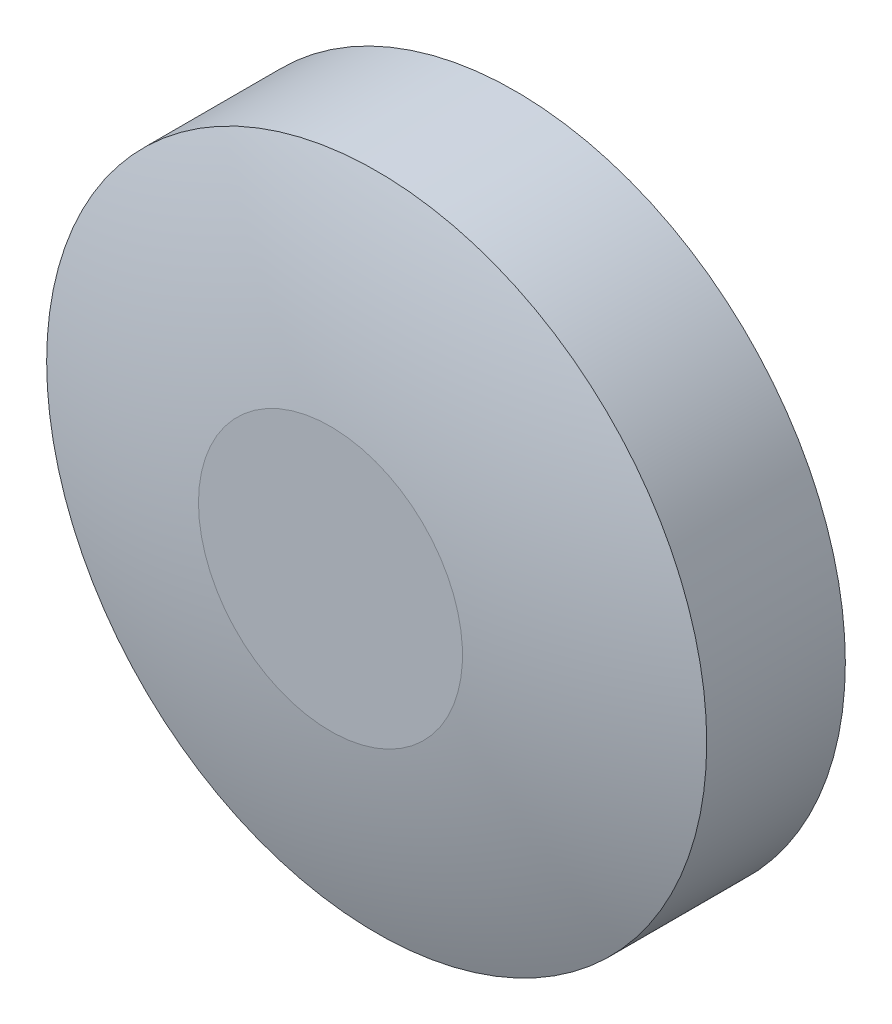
ISO-10303-21;
HEADER;
FILE_DESCRIPTION(('STEP AP214'),'2;1');
FILE_NAME('part.step','',(''),(''),'','','');
FILE_SCHEMA(('AUTOMOTIVE_DESIGN { 1 0 10303 214 1 1 1 1 }'));
ENDSEC;
DATA;
#1=APPLICATION_CONTEXT('core data for automotive mechanical design processes');
#2=APPLICATION_PROTOCOL_DEFINITION('international standard','automotive_design',2000,#1);
#3=PRODUCT_CONTEXT('',#1,'mechanical');
#4=PRODUCT('Part','Part','',(#3));
#5=PRODUCT_RELATED_PRODUCT_CATEGORY('part','',(#4));
#6=PRODUCT_DEFINITION_FORMATION('','',#4);
#7=PRODUCT_DEFINITION_CONTEXT('part definition',#1,'design');
#8=PRODUCT_DEFINITION('design','',#6,#7);
#9=PRODUCT_DEFINITION_SHAPE('','',#8);
#10=(LENGTH_UNIT() NAMED_UNIT(*) SI_UNIT(.MILLI.,.METRE.));
#11=(NAMED_UNIT(*) PLANE_ANGLE_UNIT() SI_UNIT($,.RADIAN.));
#12=(NAMED_UNIT(*) SI_UNIT($,.STERADIAN.) SOLID_ANGLE_UNIT());
#13=UNCERTAINTY_MEASURE_WITH_UNIT(LENGTH_MEASURE(1.E-05),#10,'distance_accuracy_value','');
#14=(GEOMETRIC_REPRESENTATION_CONTEXT(3) GLOBAL_UNCERTAINTY_ASSIGNED_CONTEXT((#13)) GLOBAL_UNIT_ASSIGNED_CONTEXT((#10,
#11,#12)) REPRESENTATION_CONTEXT('',''));
#15=CARTESIAN_POINT('',(0.,0.,0.));
#16=DIRECTION('',(0.,0.,1.));
#17=DIRECTION('',(1.,0.,0.));
#18=AXIS2_PLACEMENT_3D('',#15,#16,#17);
#19=CARTESIAN_POINT('',(0.,3.51386831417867,9.));
#20=DIRECTION('',(0.,0.,-1.));
#21=DIRECTION('',(-1.,0.,0.));
#22=AXIS2_PLACEMENT_3D('',#19,#20,#21);
#23=PLANE('',#22);
#24=CARTESIAN_POINT('',(0.,0.,9.));
#25=DIRECTION('',(0.,0.,-1.));
#26=DIRECTION('',(-1.,0.,0.));
#27=AXIS2_PLACEMENT_3D('',#24,#25,#26);
#28=CIRCLE('',#27,7.02773662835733);
#29=CARTESIAN_POINT('',(-7.02773662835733,0.,9.));
#30=VERTEX_POINT('',#29);
#31=EDGE_CURVE('E15',#30,#30,#28,.T.);
#32=ORIENTED_EDGE('',*,*,#31,.T.);
#33=EDGE_LOOP('',(#32));
#34=FACE_BOUND('',#33,.T.);
#35=ADVANCED_FACE('F12',(#34),#23,.T.);
#36=CARTESIAN_POINT('',(0.,0.,6.70647187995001));
#37=DIRECTION('',(0.,0.,-1.));
#38=DIRECTION('',(-1.,0.,0.));
#39=AXIS2_PLACEMENT_3D('',#36,#37,#38);
#40=CONICAL_SURFACE('',#39,16.8571428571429,1.3415643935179);
#41=ORIENTED_EDGE('',*,*,#31,.F.);
#42=EDGE_LOOP('',(#41));
#43=FACE_BOUND('',#42,.T.);
#44=CARTESIAN_POINT('',(0.,0.,6.70647187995));
#45=DIRECTION('',(0.,0.,1.));
#46=DIRECTION('',(1.,0.,0.));
#47=AXIS2_PLACEMENT_3D('',#44,#45,#46);
#48=CIRCLE('',#47,16.8571428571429);
#49=CARTESIAN_POINT('',(16.8571428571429,0.,6.70647187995));
#50=VERTEX_POINT('',#49);
#51=EDGE_CURVE('E29',#50,#50,#48,.F.);
#52=ORIENTED_EDGE('',*,*,#51,.T.);
#53=EDGE_LOOP('',(#52));
#54=FACE_BOUND('',#53,.T.);
#55=ADVANCED_FACE('F41',(#43,#54),#40,.F.);
#56=CARTESIAN_POINT('',(0.,0.,3.35323593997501));
#57=DIRECTION('',(0.,0.,1.));
#58=DIRECTION('',(1.,0.,0.));
#59=AXIS2_PLACEMENT_3D('',#56,#57,#58);
#60=CYLINDRICAL_SURFACE('',#59,16.8571428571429);
#61=ORIENTED_EDGE('',*,*,#51,.F.);
#62=EDGE_LOOP('',(#61));
#63=FACE_BOUND('',#62,.T.);
#64=CARTESIAN_POINT('',(0.,0.,0.));
#65=DIRECTION('',(0.,0.,1.));
#66=DIRECTION('',(1.,0.,0.));
#67=AXIS2_PLACEMENT_3D('',#64,#65,#66);
#68=CIRCLE('',#67,16.8571428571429);
#69=CARTESIAN_POINT('',(16.8571428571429,0.,0.));
#70=VERTEX_POINT('',#69);
#71=EDGE_CURVE('E31',#70,#70,#68,.T.);
#72=ORIENTED_EDGE('',*,*,#71,.F.);
#73=EDGE_LOOP('',(#72));
#74=FACE_BOUND('',#73,.T.);
#75=ADVANCED_FACE('F39',(#63,#74),#60,.F.);
#76=CARTESIAN_POINT('',(0.,17.3571428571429,0.));
#77=DIRECTION('',(0.,0.,-1.));
#78=DIRECTION('',(-1.,0.,0.));
#79=AXIS2_PLACEMENT_3D('',#76,#77,#78);
#80=PLANE('',#79);
#81=CARTESIAN_POINT('',(0.,0.,0.));
#82=DIRECTION('',(0.,0.,1.));
#83=DIRECTION('',(1.,0.,0.));
#84=AXIS2_PLACEMENT_3D('',#81,#82,#83);
#85=CIRCLE('',#84,17.8571428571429);
#86=CARTESIAN_POINT('',(17.8571428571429,0.,0.));
#87=VERTEX_POINT('',#86);
#88=EDGE_CURVE('E24',#87,#87,#85,.T.);
#89=ORIENTED_EDGE('',*,*,#88,.F.);
#90=EDGE_LOOP('',(#89));
#91=FACE_BOUND('',#90,.T.);
#92=ORIENTED_EDGE('',*,*,#71,.T.);
#93=EDGE_LOOP('',(#92));
#94=FACE_BOUND('',#93,.T.);
#95=ADVANCED_FACE('F37',(#91,#94),#80,.T.);
#96=CARTESIAN_POINT('',(0.,3.57142857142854,10.));
#97=DIRECTION('',(0.,0.,1.));
#98=DIRECTION('',(0.,1.,0.));
#99=AXIS2_PLACEMENT_3D('',#96,#97,#98);
#100=PLANE('',#99);
#101=CARTESIAN_POINT('',(0.,0.,10.));
#102=DIRECTION('',(0.,0.,-1.));
#103=DIRECTION('',(-1.,0.,0.));
#104=AXIS2_PLACEMENT_3D('',#101,#102,#103);
#105=CIRCLE('',#104,7.14285714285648);
#106=CARTESIAN_POINT('',(-7.14285714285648,0.,10.));
#107=VERTEX_POINT('',#106);
#108=EDGE_CURVE('E19',#107,#107,#105,.T.);
#109=ORIENTED_EDGE('',*,*,#108,.F.);
#110=EDGE_LOOP('',(#109));
#111=FACE_BOUND('',#110,.T.);
#112=ADVANCED_FACE('F50',(#111),#100,.T.);
#113=CARTESIAN_POINT('',(0.,0.,3.75));
#114=DIRECTION('',(0.,0.,1.));
#115=DIRECTION('',(1.,0.,0.));
#116=AXIS2_PLACEMENT_3D('',#113,#114,#115);
#117=CYLINDRICAL_SURFACE('',#116,17.8571428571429);
#118=ORIENTED_EDGE('',*,*,#88,.T.);
#119=EDGE_LOOP('',(#118));
#120=FACE_BOUND('',#119,.T.);
#121=CARTESIAN_POINT('',(0.,0.,7.5));
#122=DIRECTION('',(0.,0.,-1.));
#123=DIRECTION('',(-1.,0.,0.));
#124=AXIS2_PLACEMENT_3D('',#121,#122,#123);
#125=CIRCLE('',#124,17.8571428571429);
#126=CARTESIAN_POINT('',(-17.8571428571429,0.,7.5));
#127=VERTEX_POINT('',#126);
#128=EDGE_CURVE('E8',#127,#127,#125,.F.);
#129=ORIENTED_EDGE('',*,*,#128,.F.);
#130=EDGE_LOOP('',(#129));
#131=FACE_BOUND('',#130,.T.);
#132=ADVANCED_FACE('F57',(#120,#131),#117,.T.);
#133=CARTESIAN_POINT('',(-1.20749161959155,0.,-39.6464644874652));
#134=DIRECTION('',(0.,1.,0.));
#135=DIRECTION('',(-1.,0.,0.));
#136=AXIS2_PLACEMENT_3D('',#133,#134,#135);
#137=CIRCLE('',#136,49.9999999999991);
#138=TRIMMED_CURVE('',#137,(PARAMETER_VALUE(-1.5949485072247)),
(PARAMETER_VALUE(1.5949485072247)),.T.,.PARAMETER.);
#139=CARTESIAN_POINT('',(0.,0.,-39.6464644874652));
#140=DIRECTION('',(0.,0.,-1.));
#141=AXIS1_PLACEMENT('',#139,#140);
#142=SURFACE_OF_REVOLUTION('',#138,#141);
#143=ORIENTED_EDGE('',*,*,#108,.T.);
#144=EDGE_LOOP('',(#143));
#145=FACE_BOUND('',#144,.T.);
#146=ORIENTED_EDGE('',*,*,#128,.T.);
#147=EDGE_LOOP('',(#146));
#148=FACE_BOUND('',#147,.T.);
#149=ADVANCED_FACE('F55',(#145,#148),#142,.F.);
#150=CLOSED_SHELL('',(#35,#55,#75,#95,#112,#132,#149));
#151=MANIFOLD_SOLID_BREP('B1',#150);
#152=ADVANCED_BREP_SHAPE_REPRESENTATION('',(#18,#151),#14);
#153=SHAPE_DEFINITION_REPRESENTATION(#9,#152);
ENDSEC;
END-ISO-10303-21;
